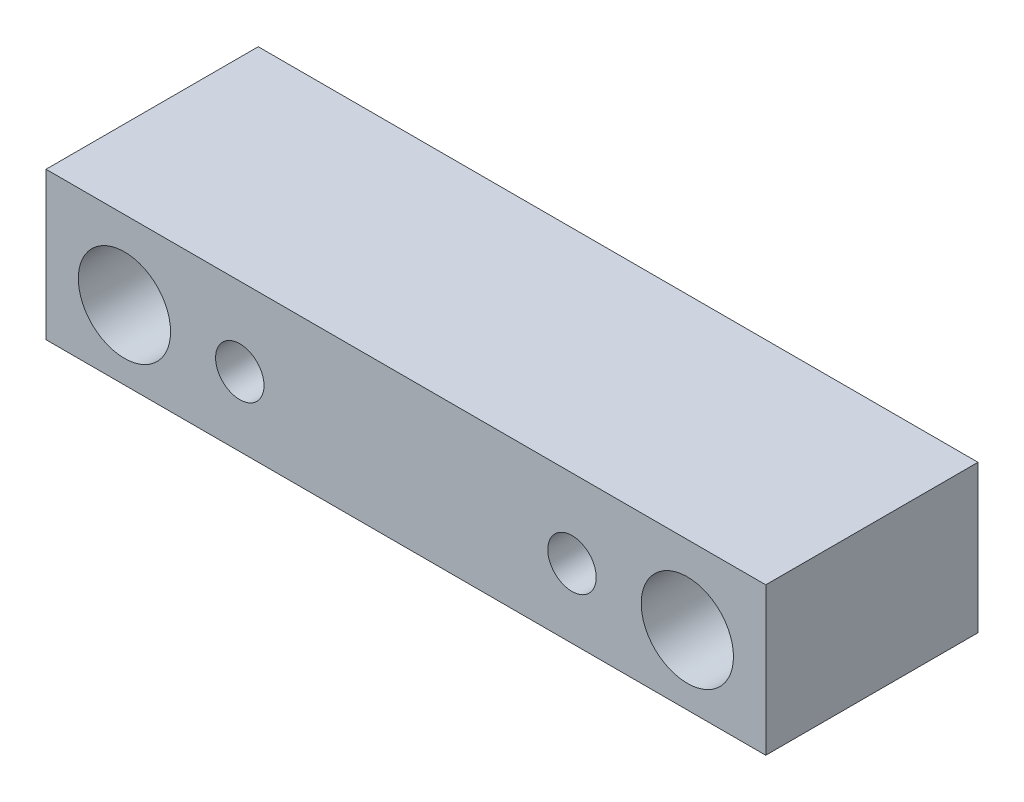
from build123d import *

# Parameters (mm, degrees)
ESQUISSE1_W             = 156
ESQUISSE1_H             = 32
EXTRUSION1_DEPTH        = 46
ESQUISSE2_R             = 10
ESQUISSE2_R_2           = 5.25
ENL_V_MAT_EXTRU_1_DEPTH = 92.956511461


with BuildPart() as part:
    # Esquisse1 → Extrusion1 (new body)
    with BuildSketch(Plane.XY):
        Rectangle(ESQUISSE1_W, ESQUISSE1_H)
    extrude(amount=EXTRUSION1_DEPTH)

    # Esquisse2 → Enl_v. mat.-Extru.1 (cut, through all)
    with BuildSketch(Plane.XY.offset(46)):
        with Locations((-61, -1)):
            Circle(ESQUISSE2_R)
        with Locations((61, -1)):
            Circle(ESQUISSE2_R)
        with Locations((-36, -1)):
            Circle(ESQUISSE2_R_2)
        with Locations((36, -1)):
            Circle(ESQUISSE2_R_2)
    extrude(amount=-ENL_V_MAT_EXTRU_1_DEPTH, mode=Mode.SUBTRACT)


solid = part.part
